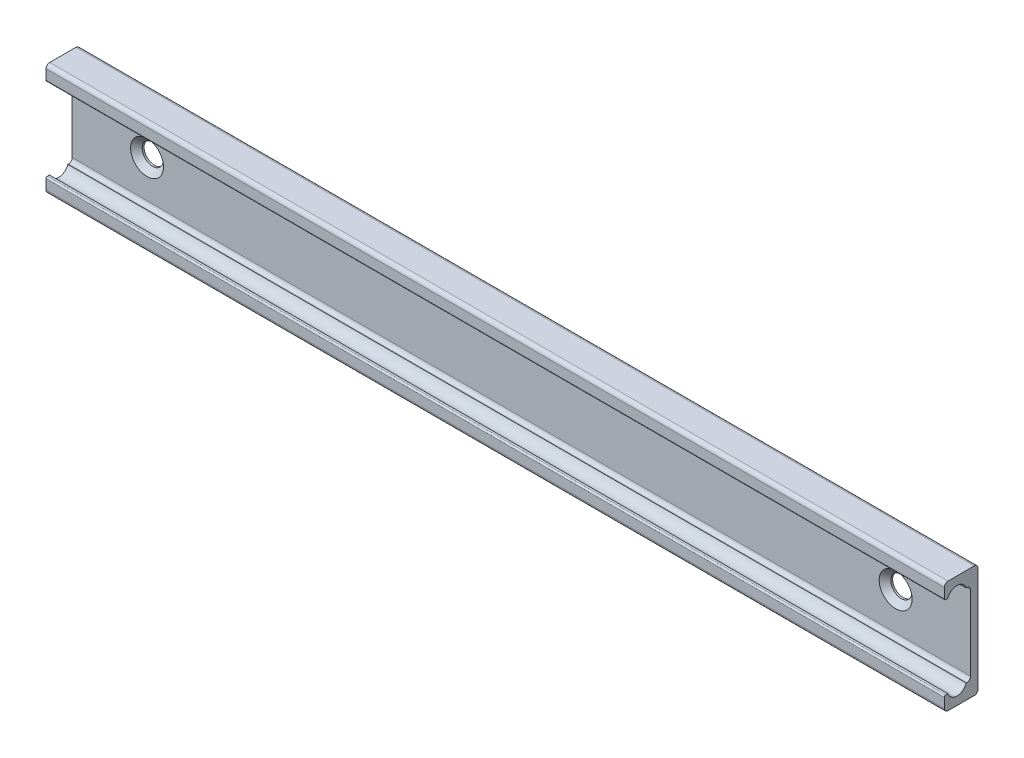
ISO-10303-21;
HEADER;
FILE_DESCRIPTION(('STEP AP214'),'2;1');
FILE_NAME('part.step','',(''),(''),'','','');
FILE_SCHEMA(('AUTOMOTIVE_DESIGN { 1 0 10303 214 1 1 1 1 }'));
ENDSEC;
DATA;
#1=APPLICATION_CONTEXT('core data for automotive mechanical design processes');
#2=APPLICATION_PROTOCOL_DEFINITION('international standard','automotive_design',2000,#1);
#3=PRODUCT_CONTEXT('',#1,'mechanical');
#4=PRODUCT('Part','Part','',(#3));
#5=PRODUCT_RELATED_PRODUCT_CATEGORY('part','',(#4));
#6=PRODUCT_DEFINITION_FORMATION('','',#4);
#7=PRODUCT_DEFINITION_CONTEXT('part definition',#1,'design');
#8=PRODUCT_DEFINITION('design','',#6,#7);
#9=PRODUCT_DEFINITION_SHAPE('','',#8);
#10=(LENGTH_UNIT() NAMED_UNIT(*) SI_UNIT(.MILLI.,.METRE.));
#11=(NAMED_UNIT(*) PLANE_ANGLE_UNIT() SI_UNIT($,.RADIAN.));
#12=(NAMED_UNIT(*) SI_UNIT($,.STERADIAN.) SOLID_ANGLE_UNIT());
#13=UNCERTAINTY_MEASURE_WITH_UNIT(LENGTH_MEASURE(1.E-05),#10,'distance_accuracy_value','');
#14=(GEOMETRIC_REPRESENTATION_CONTEXT(3) GLOBAL_UNCERTAINTY_ASSIGNED_CONTEXT((#13)) GLOBAL_UNIT_ASSIGNED_CONTEXT((#10,
#11,#12)) REPRESENTATION_CONTEXT('',''));
#15=CARTESIAN_POINT('',(0.,0.,0.));
#16=DIRECTION('',(0.,0.,1.));
#17=DIRECTION('',(1.,0.,0.));
#18=AXIS2_PLACEMENT_3D('',#15,#16,#17);
#19=CARTESIAN_POINT('',(110.,5.69999999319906,4.5));
#20=DIRECTION('',(0.,0.,1.));
#21=DIRECTION('',(1.,0.,0.));
#22=AXIS2_PLACEMENT_3D('',#19,#20,#21);
#23=PLANE('',#22);
#24=DIRECTION('',(0.,1.,0.));
#25=VECTOR('',#24,1.);
#26=CARTESIAN_POINT('',(-10.,5.69999999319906,4.5));
#27=LINE('',#26,#25);
#28=CARTESIAN_POINT('',(-10.,5.69999999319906,4.5));
#29=VERTEX_POINT('',#28);
#30=CARTESIAN_POINT('',(-10.,7.,4.5));
#31=VERTEX_POINT('',#30);
#32=EDGE_CURVE('E258',#29,#31,#27,.T.);
#33=ORIENTED_EDGE('',*,*,#32,.F.);
#34=DIRECTION('',(-1.,0.,0.));
#35=VECTOR('',#34,1.);
#36=CARTESIAN_POINT('',(110.,5.69999999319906,4.5));
#37=LINE('',#36,#35);
#38=CARTESIAN_POINT('',(110.,5.69999999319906,4.5));
#39=VERTEX_POINT('',#38);
#40=EDGE_CURVE('E9',#39,#29,#37,.T.);
#41=ORIENTED_EDGE('',*,*,#40,.F.);
#42=DIRECTION('',(0.,1.,0.));
#43=VECTOR('',#42,1.);
#44=CARTESIAN_POINT('',(110.,5.69999999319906,4.5));
#45=LINE('',#44,#43);
#46=CARTESIAN_POINT('',(110.,7.,4.5));
#47=VERTEX_POINT('',#46);
#48=EDGE_CURVE('E197',#39,#47,#45,.T.);
#49=ORIENTED_EDGE('',*,*,#48,.T.);
#50=DIRECTION('',(-1.,0.,0.));
#51=VECTOR('',#50,1.);
#52=CARTESIAN_POINT('',(114.53348651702,7.,4.5));
#53=LINE('',#52,#51);
#54=EDGE_CURVE('E294',#47,#31,#53,.T.);
#55=ORIENTED_EDGE('',*,*,#54,.T.);
#56=EDGE_LOOP('',(#33,#41,#49,#55));
#57=FACE_BOUND('',#56,.T.);
#58=ADVANCED_FACE('F14',(#57),#23,.T.);
#59=CARTESIAN_POINT('',(110.,5.69999999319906,4.3));
#60=DIRECTION('',(-1.,0.,0.));
#61=DIRECTION('',(0.,0.,1.));
#62=AXIS2_PLACEMENT_3D('',#59,#60,#61);
#63=CYLINDRICAL_SURFACE('',#62,0.2);
#64=CARTESIAN_POINT('',(-10.,5.69999999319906,4.3));
#65=DIRECTION('',(-1.,0.,0.));
#66=DIRECTION('',(0.,0.,-1.));
#67=AXIS2_PLACEMENT_3D('',#64,#65,#66);
#68=CIRCLE('',#67,0.2);
#69=CARTESIAN_POINT('',(-10.,5.49999999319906,4.3));
#70=VERTEX_POINT('',#69);
#71=EDGE_CURVE('E255',#70,#29,#68,.T.);
#72=ORIENTED_EDGE('',*,*,#71,.F.);
#73=DIRECTION('',(-1.,0.,0.));
#74=VECTOR('',#73,1.);
#75=CARTESIAN_POINT('',(110.,5.49999999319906,4.3));
#76=LINE('',#75,#74);
#77=CARTESIAN_POINT('',(110.,5.49999999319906,4.3));
#78=VERTEX_POINT('',#77);
#79=EDGE_CURVE('E23',#78,#70,#76,.T.);
#80=ORIENTED_EDGE('',*,*,#79,.F.);
#81=CARTESIAN_POINT('',(110.,5.69999999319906,4.3));
#82=DIRECTION('',(-1.,0.,0.));
#83=DIRECTION('',(0.,0.,-1.));
#84=AXIS2_PLACEMENT_3D('',#81,#82,#83);
#85=CIRCLE('',#84,0.2);
#86=EDGE_CURVE('E194',#78,#39,#85,.T.);
#87=ORIENTED_EDGE('',*,*,#86,.T.);
#88=ORIENTED_EDGE('',*,*,#40,.T.);
#89=EDGE_LOOP('',(#72,#80,#87,#88));
#90=FACE_BOUND('',#89,.T.);
#91=ADVANCED_FACE('F341',(#90),#63,.T.);
#92=CARTESIAN_POINT('',(110.,5.49999999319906,3.97687617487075));
#93=DIRECTION('',(0.,-1.,0.));
#94=DIRECTION('',(1.,0.,0.));
#95=AXIS2_PLACEMENT_3D('',#92,#93,#94);
#96=PLANE('',#95);
#97=DIRECTION('',(-1.,0.,0.));
#98=VECTOR('',#97,1.);
#99=CARTESIAN_POINT('',(110.,5.49999999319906,4.03641754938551));
#100=LINE('',#99,#98);
#101=CARTESIAN_POINT('',(110.,5.49999999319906,4.03641754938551));
#102=VERTEX_POINT('',#101);
#103=CARTESIAN_POINT('',(-10.,5.49999999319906,4.03641754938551));
#104=VERTEX_POINT('',#103);
#105=EDGE_CURVE('E31',#102,#104,#100,.T.);
#106=ORIENTED_EDGE('',*,*,#105,.F.);
#107=DIRECTION('',(0.,0.,1.));
#108=VECTOR('',#107,1.);
#109=CARTESIAN_POINT('',(110.,5.49999999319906,3.97687617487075));
#110=LINE('',#109,#108);
#111=EDGE_CURVE('E192',#102,#78,#110,.T.);
#112=ORIENTED_EDGE('',*,*,#111,.T.);
#113=ORIENTED_EDGE('',*,*,#79,.T.);
#114=DIRECTION('',(0.,0.,1.));
#115=VECTOR('',#114,1.);
#116=CARTESIAN_POINT('',(-10.,5.49999999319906,3.97687617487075));
#117=LINE('',#116,#115);
#118=EDGE_CURVE('E253',#104,#70,#117,.T.);
#119=ORIENTED_EDGE('',*,*,#118,.F.);
#120=EDGE_LOOP('',(#106,#112,#113,#119));
#121=FACE_BOUND('',#120,.T.);
#122=ADVANCED_FACE('F348',(#121),#96,.T.);
#123=CARTESIAN_POINT('',(110.,5.5,1.5));
#124=DIRECTION('',(0.,-1.,-4.7517935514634E-08));
#125=DIRECTION('',(0.,-4.7517935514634E-08,1.));
#126=AXIS2_PLACEMENT_3D('',#123,#124,#125);
#127=PLANE('',#126);
#128=DIRECTION('',(-1.,0.,0.));
#129=VECTOR('',#128,1.);
#130=CARTESIAN_POINT('',(110.,5.49999999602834,1.58358245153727));
#131=LINE('',#130,#129);
#132=CARTESIAN_POINT('',(-10.,5.49999999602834,1.58358245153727));
#133=VERTEX_POINT('',#132);
#134=CARTESIAN_POINT('',(110.,5.49999999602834,1.58358245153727));
#135=VERTEX_POINT('',#134);
#136=EDGE_CURVE('E168',#133,#135,#131,.F.);
#137=ORIENTED_EDGE('',*,*,#136,.F.);
#138=DIRECTION('',(0.,-4.7517935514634E-08,1.));
#139=VECTOR('',#138,1.);
#140=CARTESIAN_POINT('',(-10.,5.5,1.5));
#141=LINE('',#140,#139);
#142=CARTESIAN_POINT('',(-10.,5.5,1.5));
#143=VERTEX_POINT('',#142);
#144=EDGE_CURVE('E250',#143,#133,#141,.T.);
#145=ORIENTED_EDGE('',*,*,#144,.F.);
#146=DIRECTION('',(-1.,0.,0.));
#147=VECTOR('',#146,1.);
#148=CARTESIAN_POINT('',(110.,5.5,1.5));
#149=LINE('',#148,#147);
#150=CARTESIAN_POINT('',(110.,5.5,1.5));
#151=VERTEX_POINT('',#150);
#152=EDGE_CURVE('E202',#151,#143,#149,.T.);
#153=ORIENTED_EDGE('',*,*,#152,.F.);
#154=DIRECTION('',(0.,-4.7517935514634E-08,1.));
#155=VECTOR('',#154,1.);
#156=CARTESIAN_POINT('',(110.,5.5,1.5));
#157=LINE('',#156,#155);
#158=EDGE_CURVE('E189',#151,#135,#157,.T.);
#159=ORIENTED_EDGE('',*,*,#158,.T.);
#160=EDGE_LOOP('',(#137,#145,#153,#159));
#161=FACE_BOUND('',#160,.T.);
#162=ADVANCED_FACE('F357',(#161),#127,.T.);
#163=CARTESIAN_POINT('',(110.,5.,1.5));
#164=DIRECTION('',(-1.,0.,0.));
#165=DIRECTION('',(0.,0.,1.));
#166=AXIS2_PLACEMENT_3D('',#163,#164,#165);
#167=CYLINDRICAL_SURFACE('',#166,0.5);
#168=CARTESIAN_POINT('',(-10.,5.,1.5));
#169=DIRECTION('',(1.,0.,0.));
#170=DIRECTION('',(0.,0.,1.));
#171=AXIS2_PLACEMENT_3D('',#168,#169,#170);
#172=CIRCLE('',#171,0.5);
#173=CARTESIAN_POINT('',(-10.,5.,1.));
#174=VERTEX_POINT('',#173);
#175=EDGE_CURVE('E247',#174,#143,#172,.T.);
#176=ORIENTED_EDGE('',*,*,#175,.F.);
#177=DIRECTION('',(-1.,0.,0.));
#178=VECTOR('',#177,1.);
#179=CARTESIAN_POINT('',(110.,5.,1.));
#180=LINE('',#179,#178);
#181=CARTESIAN_POINT('',(110.,5.,1.));
#182=VERTEX_POINT('',#181);
#183=EDGE_CURVE('E204',#182,#174,#180,.T.);
#184=ORIENTED_EDGE('',*,*,#183,.F.);
#185=CARTESIAN_POINT('',(110.,5.,1.5));
#186=DIRECTION('',(1.,0.,0.));
#187=DIRECTION('',(0.,0.,1.));
#188=AXIS2_PLACEMENT_3D('',#185,#186,#187);
#189=CIRCLE('',#188,0.5);
#190=EDGE_CURVE('E186',#182,#151,#189,.T.);
#191=ORIENTED_EDGE('',*,*,#190,.T.);
#192=ORIENTED_EDGE('',*,*,#152,.T.);
#193=EDGE_LOOP('',(#176,#184,#191,#192));
#194=FACE_BOUND('',#193,.T.);
#195=ADVANCED_FACE('F361',(#194),#167,.F.);
#196=CARTESIAN_POINT('',(110.,-5.,1.));
#197=DIRECTION('',(0.,0.,1.));
#198=DIRECTION('',(1.,0.,0.));
#199=AXIS2_PLACEMENT_3D('',#196,#197,#198);
#200=PLANE('',#199);
#201=CARTESIAN_POINT('',(100.,0.,1.));
#202=DIRECTION('',(0.,0.,1.));
#203=DIRECTION('',(1.,0.,0.));
#204=AXIS2_PLACEMENT_3D('',#201,#202,#203);
#205=CIRCLE('',#204,2.2);
#206=CARTESIAN_POINT('',(102.2,0.,1.));
#207=VERTEX_POINT('',#206);
#208=EDGE_CURVE('E222',#207,#207,#205,.T.);
#209=ORIENTED_EDGE('',*,*,#208,.F.);
#210=EDGE_LOOP('',(#209));
#211=FACE_BOUND('',#210,.T.);
#212=CARTESIAN_POINT('',(0.,0.,1.));
#213=DIRECTION('',(0.,0.,1.));
#214=DIRECTION('',(1.,0.,0.));
#215=AXIS2_PLACEMENT_3D('',#212,#213,#214);
#216=CIRCLE('',#215,2.2);
#217=CARTESIAN_POINT('',(2.2,0.,1.));
#218=VERTEX_POINT('',#217);
#219=EDGE_CURVE('E214',#218,#218,#216,.T.);
#220=ORIENTED_EDGE('',*,*,#219,.F.);
#221=EDGE_LOOP('',(#220));
#222=FACE_BOUND('',#221,.T.);
#223=DIRECTION('',(0.,1.,0.));
#224=VECTOR('',#223,1.);
#225=CARTESIAN_POINT('',(-10.,-5.,1.));
#226=LINE('',#225,#224);
#227=CARTESIAN_POINT('',(-10.,-5.,1.));
#228=VERTEX_POINT('',#227);
#229=EDGE_CURVE('E244',#228,#174,#226,.T.);
#230=ORIENTED_EDGE('',*,*,#229,.F.);
#231=DIRECTION('',(-1.,0.,0.));
#232=VECTOR('',#231,1.);
#233=CARTESIAN_POINT('',(110.,-5.,1.));
#234=LINE('',#233,#232);
#235=CARTESIAN_POINT('',(110.,-5.,1.));
#236=VERTEX_POINT('',#235);
#237=EDGE_CURVE('E206',#236,#228,#234,.T.);
#238=ORIENTED_EDGE('',*,*,#237,.F.);
#239=DIRECTION('',(0.,1.,0.));
#240=VECTOR('',#239,1.);
#241=CARTESIAN_POINT('',(110.,-5.,1.));
#242=LINE('',#241,#240);
#243=EDGE_CURVE('E178',#236,#182,#242,.T.);
#244=ORIENTED_EDGE('',*,*,#243,.T.);
#245=ORIENTED_EDGE('',*,*,#183,.T.);
#246=EDGE_LOOP('',(#230,#238,#244,#245));
#247=FACE_BOUND('',#246,.T.);
#248=ADVANCED_FACE('F365',(#211,#222,#247),#200,.T.);
#249=CARTESIAN_POINT('',(110.,-5.,1.5));
#250=DIRECTION('',(-1.,0.,0.));
#251=DIRECTION('',(0.,0.,1.));
#252=AXIS2_PLACEMENT_3D('',#249,#250,#251);
#253=CYLINDRICAL_SURFACE('',#252,0.5);
#254=CARTESIAN_POINT('',(-10.,-5.,1.5));
#255=DIRECTION('',(1.,0.,0.));
#256=DIRECTION('',(0.,0.,-1.));
#257=AXIS2_PLACEMENT_3D('',#254,#255,#256);
#258=CIRCLE('',#257,0.5);
#259=CARTESIAN_POINT('',(-10.,-5.5,1.5));
#260=VERTEX_POINT('',#259);
#261=EDGE_CURVE('E241',#260,#228,#258,.T.);
#262=ORIENTED_EDGE('',*,*,#261,.F.);
#263=DIRECTION('',(-1.,0.,0.));
#264=VECTOR('',#263,1.);
#265=CARTESIAN_POINT('',(110.,-5.5,1.5));
#266=LINE('',#265,#264);
#267=CARTESIAN_POINT('',(110.,-5.5,1.5));
#268=VERTEX_POINT('',#267);
#269=EDGE_CURVE('E208',#268,#260,#266,.T.);
#270=ORIENTED_EDGE('',*,*,#269,.F.);
#271=CARTESIAN_POINT('',(110.,-5.,1.5));
#272=DIRECTION('',(1.,0.,0.));
#273=DIRECTION('',(0.,0.,-1.));
#274=AXIS2_PLACEMENT_3D('',#271,#272,#273);
#275=CIRCLE('',#274,0.5);
#276=EDGE_CURVE('E175',#268,#236,#275,.T.);
#277=ORIENTED_EDGE('',*,*,#276,.T.);
#278=ORIENTED_EDGE('',*,*,#237,.T.);
#279=EDGE_LOOP('',(#262,#270,#277,#278));
#280=FACE_BOUND('',#279,.T.);
#281=ADVANCED_FACE('F369',(#280),#253,.F.);
#282=CARTESIAN_POINT('',(110.,-5.5,1.5));
#283=DIRECTION('',(0.,1.,-4.7517935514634E-08));
#284=DIRECTION('',(0.,-4.7517935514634E-08,-1.));
#285=AXIS2_PLACEMENT_3D('',#282,#283,#284);
#286=PLANE('',#285);
#287=DIRECTION('',(-1.,0.,0.));
#288=VECTOR('',#287,1.);
#289=CARTESIAN_POINT('',(110.,-5.49999999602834,1.58358245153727));
#290=LINE('',#289,#288);
#291=CARTESIAN_POINT('',(110.,-5.49999999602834,1.58358245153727));
#292=VERTEX_POINT('',#291);
#293=CARTESIAN_POINT('',(-10.,-5.49999999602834,1.58358245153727));
#294=VERTEX_POINT('',#293);
#295=EDGE_CURVE('E39',#292,#294,#290,.T.);
#296=ORIENTED_EDGE('',*,*,#295,.F.);
#297=DIRECTION('',(0.,-4.7517935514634E-08,-1.));
#298=VECTOR('',#297,1.);
#299=CARTESIAN_POINT('',(110.,-5.5,1.5));
#300=LINE('',#299,#298);
#301=EDGE_CURVE('E165',#292,#268,#300,.T.);
#302=ORIENTED_EDGE('',*,*,#301,.T.);
#303=ORIENTED_EDGE('',*,*,#269,.T.);
#304=DIRECTION('',(0.,-4.7517935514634E-08,-1.));
#305=VECTOR('',#304,1.);
#306=CARTESIAN_POINT('',(-10.,-5.5,1.5));
#307=LINE('',#306,#305);
#308=EDGE_CURVE('E167',#294,#260,#307,.T.);
#309=ORIENTED_EDGE('',*,*,#308,.F.);
#310=EDGE_LOOP('',(#296,#302,#303,#309));
#311=FACE_BOUND('',#310,.T.);
#312=ADVANCED_FACE('F163',(#311),#286,.T.);
#313=CARTESIAN_POINT('',(110.,-5.49999999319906,3.97687617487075));
#314=DIRECTION('',(0.,1.,0.));
#315=DIRECTION('',(-1.,0.,0.));
#316=AXIS2_PLACEMENT_3D('',#313,#314,#315);
#317=PLANE('',#316);
#318=DIRECTION('',(-1.,0.,0.));
#319=VECTOR('',#318,1.);
#320=CARTESIAN_POINT('',(110.,-5.49999999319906,4.03641754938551));
#321=LINE('',#320,#319);
#322=CARTESIAN_POINT('',(-10.,-5.49999999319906,4.03641754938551));
#323=VERTEX_POINT('',#322);
#324=CARTESIAN_POINT('',(110.,-5.49999999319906,4.03641754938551));
#325=VERTEX_POINT('',#324);
#326=EDGE_CURVE('E153',#323,#325,#321,.F.);
#327=ORIENTED_EDGE('',*,*,#326,.F.);
#328=DIRECTION('',(0.,0.,-1.));
#329=VECTOR('',#328,1.);
#330=CARTESIAN_POINT('',(-10.,-5.49999999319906,3.97687617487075));
#331=LINE('',#330,#329);
#332=CARTESIAN_POINT('',(-10.,-5.49999999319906,4.3));
#333=VERTEX_POINT('',#332);
#334=EDGE_CURVE('E237',#333,#323,#331,.T.);
#335=ORIENTED_EDGE('',*,*,#334,.F.);
#336=DIRECTION('',(-1.,0.,0.));
#337=VECTOR('',#336,1.);
#338=CARTESIAN_POINT('',(110.,-5.49999999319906,4.3));
#339=LINE('',#338,#337);
#340=CARTESIAN_POINT('',(110.,-5.49999999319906,4.3));
#341=VERTEX_POINT('',#340);
#342=EDGE_CURVE('E210',#341,#333,#339,.T.);
#343=ORIENTED_EDGE('',*,*,#342,.F.);
#344=DIRECTION('',(0.,0.,-1.));
#345=VECTOR('',#344,1.);
#346=CARTESIAN_POINT('',(110.,-5.49999999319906,3.97687617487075));
#347=LINE('',#346,#345);
#348=EDGE_CURVE('E176',#341,#325,#347,.T.);
#349=ORIENTED_EDGE('',*,*,#348,.T.);
#350=EDGE_LOOP('',(#327,#335,#343,#349));
#351=FACE_BOUND('',#350,.T.);
#352=ADVANCED_FACE('F376',(#351),#317,.T.);
#353=CARTESIAN_POINT('',(110.,-5.69999999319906,4.3));
#354=DIRECTION('',(-1.,0.,0.));
#355=DIRECTION('',(0.,0.,1.));
#356=AXIS2_PLACEMENT_3D('',#353,#354,#355);
#357=CYLINDRICAL_SURFACE('',#356,0.2);
#358=CARTESIAN_POINT('',(-10.,-5.69999999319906,4.3));
#359=DIRECTION('',(-1.,0.,0.));
#360=DIRECTION('',(0.,0.,1.));
#361=AXIS2_PLACEMENT_3D('',#358,#359,#360);
#362=CIRCLE('',#361,0.2);
#363=CARTESIAN_POINT('',(-10.,-5.69999999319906,4.5));
#364=VERTEX_POINT('',#363);
#365=EDGE_CURVE('E234',#364,#333,#362,.T.);
#366=ORIENTED_EDGE('',*,*,#365,.F.);
#367=DIRECTION('',(-1.,0.,0.));
#368=VECTOR('',#367,1.);
#369=CARTESIAN_POINT('',(110.,-5.69999999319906,4.5));
#370=LINE('',#369,#368);
#371=CARTESIAN_POINT('',(110.,-5.69999999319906,4.5));
#372=VERTEX_POINT('',#371);
#373=EDGE_CURVE('E198',#372,#364,#370,.T.);
#374=ORIENTED_EDGE('',*,*,#373,.F.);
#375=CARTESIAN_POINT('',(110.,-5.69999999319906,4.3));
#376=DIRECTION('',(-1.,0.,0.));
#377=DIRECTION('',(0.,0.,1.));
#378=AXIS2_PLACEMENT_3D('',#375,#376,#377);
#379=CIRCLE('',#378,0.2);
#380=EDGE_CURVE('E180',#372,#341,#379,.T.);
#381=ORIENTED_EDGE('',*,*,#380,.T.);
#382=ORIENTED_EDGE('',*,*,#342,.T.);
#383=EDGE_LOOP('',(#366,#374,#381,#382));
#384=FACE_BOUND('',#383,.T.);
#385=ADVANCED_FACE('F268',(#384),#357,.T.);
#386=CARTESIAN_POINT('',(110.,-5.69999999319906,4.5));
#387=DIRECTION('',(0.,0.,1.));
#388=DIRECTION('',(1.,0.,0.));
#389=AXIS2_PLACEMENT_3D('',#386,#387,#388);
#390=PLANE('',#389);
#391=DIRECTION('',(0.,1.,0.));
#392=VECTOR('',#391,1.);
#393=CARTESIAN_POINT('',(-10.,-5.69999999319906,4.5));
#394=LINE('',#393,#392);
#395=CARTESIAN_POINT('',(-10.,-7.,4.5));
#396=VERTEX_POINT('',#395);
#397=EDGE_CURVE('E231',#396,#364,#394,.T.);
#398=ORIENTED_EDGE('',*,*,#397,.F.);
#399=DIRECTION('',(-1.,0.,0.));
#400=VECTOR('',#399,1.);
#401=CARTESIAN_POINT('',(114.53348651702,-7.,4.5));
#402=LINE('',#401,#400);
#403=CARTESIAN_POINT('',(110.,-7.,4.5));
#404=VERTEX_POINT('',#403);
#405=EDGE_CURVE('E275',#404,#396,#402,.T.);
#406=ORIENTED_EDGE('',*,*,#405,.F.);
#407=DIRECTION('',(0.,1.,0.));
#408=VECTOR('',#407,1.);
#409=CARTESIAN_POINT('',(110.,-5.69999999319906,4.5));
#410=LINE('',#409,#408);
#411=EDGE_CURVE('E262',#404,#372,#410,.T.);
#412=ORIENTED_EDGE('',*,*,#411,.T.);
#413=ORIENTED_EDGE('',*,*,#373,.T.);
#414=EDGE_LOOP('',(#398,#406,#412,#413));
#415=FACE_BOUND('',#414,.T.);
#416=ADVANCED_FACE('F273',(#415),#390,.T.);
#417=CARTESIAN_POINT('',(110.,-6.95,0.));
#418=DIRECTION('',(0.,0.,-1.));
#419=DIRECTION('',(-1.,0.,0.));
#420=AXIS2_PLACEMENT_3D('',#417,#418,#419);
#421=PLANE('',#420);
#422=CARTESIAN_POINT('',(100.,0.,0.));
#423=DIRECTION('',(0.,0.,1.));
#424=DIRECTION('',(1.,0.,0.));
#425=AXIS2_PLACEMENT_3D('',#422,#423,#424);
#426=CIRCLE('',#425,1.4);
#427=CARTESIAN_POINT('',(101.4,0.,0.));
#428=VERTEX_POINT('',#427);
#429=EDGE_CURVE('E311',#428,#428,#426,.T.);
#430=ORIENTED_EDGE('',*,*,#429,.T.);
#431=EDGE_LOOP('',(#430));
#432=FACE_BOUND('',#431,.T.);
#433=CARTESIAN_POINT('',(0.,0.,0.));
#434=DIRECTION('',(0.,0.,1.));
#435=DIRECTION('',(1.,0.,0.));
#436=AXIS2_PLACEMENT_3D('',#433,#434,#435);
#437=CIRCLE('',#436,1.4);
#438=CARTESIAN_POINT('',(1.4,0.,0.));
#439=VERTEX_POINT('',#438);
#440=EDGE_CURVE('E215',#439,#439,#437,.T.);
#441=ORIENTED_EDGE('',*,*,#440,.T.);
#442=EDGE_LOOP('',(#441));
#443=FACE_BOUND('',#442,.T.);
#444=DIRECTION('',(0.,-1.,0.));
#445=VECTOR('',#444,1.);
#446=CARTESIAN_POINT('',(-10.,-6.95,0.));
#447=LINE('',#446,#445);
#448=CARTESIAN_POINT('',(-10.,7.,0.));
#449=VERTEX_POINT('',#448);
#450=CARTESIAN_POINT('',(-10.,-7.,0.));
#451=VERTEX_POINT('',#450);
#452=EDGE_CURVE('E219',#449,#451,#447,.T.);
#453=ORIENTED_EDGE('',*,*,#452,.F.);
#454=DIRECTION('',(-1.,0.,0.));
#455=VECTOR('',#454,1.);
#456=CARTESIAN_POINT('',(114.53348651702,7.,0.));
#457=LINE('',#456,#455);
#458=CARTESIAN_POINT('',(110.,7.,0.));
#459=VERTEX_POINT('',#458);
#460=EDGE_CURVE('E300',#459,#449,#457,.T.);
#461=ORIENTED_EDGE('',*,*,#460,.F.);
#462=DIRECTION('',(0.,-1.,0.));
#463=VECTOR('',#462,1.);
#464=CARTESIAN_POINT('',(110.,-6.95,0.));
#465=LINE('',#464,#463);
#466=CARTESIAN_POINT('',(110.,-7.,0.));
#467=VERTEX_POINT('',#466);
#468=EDGE_CURVE('E260',#459,#467,#465,.T.);
#469=ORIENTED_EDGE('',*,*,#468,.T.);
#470=DIRECTION('',(-1.,0.,0.));
#471=VECTOR('',#470,1.);
#472=CARTESIAN_POINT('',(114.53348651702,-7.,0.));
#473=LINE('',#472,#471);
#474=EDGE_CURVE('E289',#467,#451,#473,.T.);
#475=ORIENTED_EDGE('',*,*,#474,.T.);
#476=EDGE_LOOP('',(#453,#461,#469,#475));
#477=FACE_BOUND('',#476,.T.);
#478=ADVANCED_FACE('F16',(#432,#443,#477),#421,.T.);
#479=CARTESIAN_POINT('',(110.,6.95,0.5));
#480=DIRECTION('',(1.,0.,0.));
#481=DIRECTION('',(0.,0.,-1.));
#482=AXIS2_PLACEMENT_3D('',#479,#480,#481);
#483=PLANE('',#482);
#484=CARTESIAN_POINT('',(110.,5.1,2.81));
#485=DIRECTION('',(-1.,0.,0.));
#486=DIRECTION('',(0.,0.,1.));
#487=AXIS2_PLACEMENT_3D('',#484,#485,#486);
#488=CIRCLE('',#487,1.29);
#489=EDGE_CURVE('E435',#102,#135,#488,.T.);
#490=ORIENTED_EDGE('',*,*,#489,.T.);
#491=ORIENTED_EDGE('',*,*,#158,.F.);
#492=ORIENTED_EDGE('',*,*,#190,.F.);
#493=ORIENTED_EDGE('',*,*,#243,.F.);
#494=ORIENTED_EDGE('',*,*,#276,.F.);
#495=ORIENTED_EDGE('',*,*,#301,.F.);
#496=CARTESIAN_POINT('',(110.,-5.1,2.81));
#497=DIRECTION('',(-1.,0.,0.));
#498=DIRECTION('',(0.,0.,-1.));
#499=AXIS2_PLACEMENT_3D('',#496,#497,#498);
#500=CIRCLE('',#499,1.29);
#501=EDGE_CURVE('E150',#292,#325,#500,.T.);
#502=ORIENTED_EDGE('',*,*,#501,.T.);
#503=ORIENTED_EDGE('',*,*,#348,.F.);
#504=ORIENTED_EDGE('',*,*,#380,.F.);
#505=ORIENTED_EDGE('',*,*,#411,.F.);
#506=CARTESIAN_POINT('',(110.,-7.,4.));
#507=DIRECTION('',(1.,0.,0.));
#508=DIRECTION('',(0.,0.,-1.));
#509=AXIS2_PLACEMENT_3D('',#506,#507,#508);
#510=CIRCLE('',#509,0.5);
#511=CARTESIAN_POINT('',(110.,-7.5,4.));
#512=VERTEX_POINT('',#511);
#513=EDGE_CURVE('E280',#512,#404,#510,.F.);
#514=ORIENTED_EDGE('',*,*,#513,.F.);
#515=DIRECTION('',(0.,0.,1.));
#516=VECTOR('',#515,1.);
#517=CARTESIAN_POINT('',(110.,-7.5,0.5));
#518=LINE('',#517,#516);
#519=CARTESIAN_POINT('',(110.,-7.5,0.5));
#520=VERTEX_POINT('',#519);
#521=EDGE_CURVE('E413',#520,#512,#518,.T.);
#522=ORIENTED_EDGE('',*,*,#521,.F.);
#523=CARTESIAN_POINT('',(110.,-7.,0.5));
#524=DIRECTION('',(1.,0.,0.));
#525=DIRECTION('',(0.,0.,-1.));
#526=AXIS2_PLACEMENT_3D('',#523,#524,#525);
#527=CIRCLE('',#526,0.5);
#528=EDGE_CURVE('E411',#467,#520,#527,.F.);
#529=ORIENTED_EDGE('',*,*,#528,.F.);
#530=ORIENTED_EDGE('',*,*,#468,.F.);
#531=CARTESIAN_POINT('',(110.,7.,0.5));
#532=DIRECTION('',(1.,0.,0.));
#533=DIRECTION('',(0.,0.,-1.));
#534=AXIS2_PLACEMENT_3D('',#531,#532,#533);
#535=CIRCLE('',#534,0.5);
#536=CARTESIAN_POINT('',(110.,7.5,0.5));
#537=VERTEX_POINT('',#536);
#538=EDGE_CURVE('E297',#537,#459,#535,.F.);
#539=ORIENTED_EDGE('',*,*,#538,.F.);
#540=DIRECTION('',(0.,0.,-1.));
#541=VECTOR('',#540,1.);
#542=CARTESIAN_POINT('',(110.,7.5,0.5));
#543=LINE('',#542,#541);
#544=CARTESIAN_POINT('',(110.,7.5,4.));
#545=VERTEX_POINT('',#544);
#546=EDGE_CURVE('E302',#545,#537,#543,.T.);
#547=ORIENTED_EDGE('',*,*,#546,.F.);
#548=CARTESIAN_POINT('',(110.,7.,4.));
#549=DIRECTION('',(1.,0.,0.));
#550=DIRECTION('',(0.,0.,-1.));
#551=AXIS2_PLACEMENT_3D('',#548,#549,#550);
#552=CIRCLE('',#551,0.5);
#553=EDGE_CURVE('E306',#47,#545,#552,.F.);
#554=ORIENTED_EDGE('',*,*,#553,.F.);
#555=ORIENTED_EDGE('',*,*,#48,.F.);
#556=ORIENTED_EDGE('',*,*,#86,.F.);
#557=ORIENTED_EDGE('',*,*,#111,.F.);
#558=EDGE_LOOP('',(#490,#491,#492,#493,#494,#495,#502,#503,#504,#505,#514,#522,#529,#530,#539,
#547,#554,#555,#556,#557));
#559=FACE_BOUND('',#558,.T.);
#560=ADVANCED_FACE('F172',(#559),#483,.T.);
#561=CARTESIAN_POINT('',(-10.,6.95,0.5));
#562=DIRECTION('',(1.,0.,0.));
#563=DIRECTION('',(0.,0.,-1.));
#564=AXIS2_PLACEMENT_3D('',#561,#562,#563);
#565=PLANE('',#564);
#566=ORIENTED_EDGE('',*,*,#144,.T.);
#567=CARTESIAN_POINT('',(-10.,5.1,2.81));
#568=DIRECTION('',(-1.,0.,0.));
#569=DIRECTION('',(0.,0.,1.));
#570=AXIS2_PLACEMENT_3D('',#567,#568,#569);
#571=CIRCLE('',#570,1.29);
#572=EDGE_CURVE('E158',#104,#133,#571,.T.);
#573=ORIENTED_EDGE('',*,*,#572,.F.);
#574=ORIENTED_EDGE('',*,*,#118,.T.);
#575=ORIENTED_EDGE('',*,*,#71,.T.);
#576=ORIENTED_EDGE('',*,*,#32,.T.);
#577=CARTESIAN_POINT('',(-10.,7.,4.));
#578=DIRECTION('',(-1.,0.,0.));
#579=DIRECTION('',(0.,0.,1.));
#580=AXIS2_PLACEMENT_3D('',#577,#578,#579);
#581=CIRCLE('',#580,0.5);
#582=CARTESIAN_POINT('',(-10.,7.5,4.));
#583=VERTEX_POINT('',#582);
#584=EDGE_CURVE('E279',#31,#583,#581,.T.);
#585=ORIENTED_EDGE('',*,*,#584,.T.);
#586=DIRECTION('',(0.,0.,-1.));
#587=VECTOR('',#586,1.);
#588=CARTESIAN_POINT('',(-10.,7.5,0.5));
#589=LINE('',#588,#587);
#590=CARTESIAN_POINT('',(-10.,7.5,0.5));
#591=VERTEX_POINT('',#590);
#592=EDGE_CURVE('E283',#583,#591,#589,.T.);
#593=ORIENTED_EDGE('',*,*,#592,.T.);
#594=CARTESIAN_POINT('',(-10.,7.,0.5));
#595=DIRECTION('',(-1.,0.,0.));
#596=DIRECTION('',(0.,0.,1.));
#597=AXIS2_PLACEMENT_3D('',#594,#595,#596);
#598=CIRCLE('',#597,0.5);
#599=EDGE_CURVE('E291',#591,#449,#598,.T.);
#600=ORIENTED_EDGE('',*,*,#599,.T.);
#601=ORIENTED_EDGE('',*,*,#452,.T.);
#602=CARTESIAN_POINT('',(-10.,-7.,0.5));
#603=DIRECTION('',(-1.,0.,0.));
#604=DIRECTION('',(0.,0.,-1.));
#605=AXIS2_PLACEMENT_3D('',#602,#603,#604);
#606=CIRCLE('',#605,0.5);
#607=CARTESIAN_POINT('',(-10.,-7.5,0.5));
#608=VERTEX_POINT('',#607);
#609=EDGE_CURVE('E419',#451,#608,#606,.T.);
#610=ORIENTED_EDGE('',*,*,#609,.T.);
#611=DIRECTION('',(0.,0.,1.));
#612=VECTOR('',#611,1.);
#613=CARTESIAN_POINT('',(-10.,-7.5,0.5));
#614=LINE('',#613,#612);
#615=CARTESIAN_POINT('',(-10.,-7.5,4.));
#616=VERTEX_POINT('',#615);
#617=EDGE_CURVE('E420',#608,#616,#614,.T.);
#618=ORIENTED_EDGE('',*,*,#617,.T.);
#619=CARTESIAN_POINT('',(-10.,-7.,4.));
#620=DIRECTION('',(-1.,0.,0.));
#621=DIRECTION('',(0.,0.,-1.));
#622=AXIS2_PLACEMENT_3D('',#619,#620,#621);
#623=CIRCLE('',#622,0.5);
#624=EDGE_CURVE('E424',#616,#396,#623,.T.);
#625=ORIENTED_EDGE('',*,*,#624,.T.);
#626=ORIENTED_EDGE('',*,*,#397,.T.);
#627=ORIENTED_EDGE('',*,*,#365,.T.);
#628=ORIENTED_EDGE('',*,*,#334,.T.);
#629=CARTESIAN_POINT('',(-10.,-5.1,2.81));
#630=DIRECTION('',(-1.,0.,0.));
#631=DIRECTION('',(0.,0.,-1.));
#632=AXIS2_PLACEMENT_3D('',#629,#630,#631);
#633=CIRCLE('',#632,1.29);
#634=EDGE_CURVE('E159',#294,#323,#633,.T.);
#635=ORIENTED_EDGE('',*,*,#634,.F.);
#636=ORIENTED_EDGE('',*,*,#308,.T.);
#637=ORIENTED_EDGE('',*,*,#261,.T.);
#638=ORIENTED_EDGE('',*,*,#229,.T.);
#639=ORIENTED_EDGE('',*,*,#175,.T.);
#640=EDGE_LOOP('',(#566,#573,#574,#575,#576,#585,#593,#600,#601,#610,#618,#625,#626,#627,#628,
#635,#636,#637,#638,#639));
#641=FACE_BOUND('',#640,.T.);
#642=ADVANCED_FACE('F390',(#641),#565,.F.);
#643=CARTESIAN_POINT('',(0.,0.,1.));
#644=DIRECTION('',(0.,0.,1.));
#645=DIRECTION('',(1.,0.,0.));
#646=AXIS2_PLACEMENT_3D('',#643,#644,#645);
#647=CONICAL_SURFACE('',#646,2.2,0.820304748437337);
#648=CARTESIAN_POINT('',(0.,0.,0.253987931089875));
#649=DIRECTION('',(0.,0.,1.));
#650=DIRECTION('',(1.,0.,0.));
#651=AXIS2_PLACEMENT_3D('',#648,#649,#650);
#652=CIRCLE('',#651,1.4);
#653=CARTESIAN_POINT('',(1.4,0.,0.253987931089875));
#654=VERTEX_POINT('',#653);
#655=EDGE_CURVE('E212',#654,#654,#652,.F.);
#656=ORIENTED_EDGE('',*,*,#655,.T.);
#657=EDGE_LOOP('',(#656));
#658=FACE_BOUND('',#657,.T.);
#659=ORIENTED_EDGE('',*,*,#219,.T.);
#660=EDGE_LOOP('',(#659));
#661=FACE_BOUND('',#660,.T.);
#662=ADVANCED_FACE('F609',(#658,#661),#647,.F.);
#663=CARTESIAN_POINT('',(0.,0.,0.));
#664=DIRECTION('',(0.,0.,1.));
#665=DIRECTION('',(1.,0.,0.));
#666=AXIS2_PLACEMENT_3D('',#663,#664,#665);
#667=CYLINDRICAL_SURFACE('',#666,1.4);
#668=ORIENTED_EDGE('',*,*,#440,.F.);
#669=EDGE_LOOP('',(#668));
#670=FACE_BOUND('',#669,.T.);
#671=ORIENTED_EDGE('',*,*,#655,.F.);
#672=EDGE_LOOP('',(#671));
#673=FACE_BOUND('',#672,.T.);
#674=ADVANCED_FACE('F338',(#670,#673),#667,.F.);
#675=CARTESIAN_POINT('',(100.,0.,1.));
#676=DIRECTION('',(0.,0.,1.));
#677=DIRECTION('',(1.,0.,0.));
#678=AXIS2_PLACEMENT_3D('',#675,#676,#677);
#679=CONICAL_SURFACE('',#678,2.2,0.820304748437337);
#680=CARTESIAN_POINT('',(100.,0.,0.253987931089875));
#681=DIRECTION('',(0.,0.,1.));
#682=DIRECTION('',(1.,0.,0.));
#683=AXIS2_PLACEMENT_3D('',#680,#681,#682);
#684=CIRCLE('',#683,1.4);
#685=CARTESIAN_POINT('',(101.4,0.,0.253987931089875));
#686=VERTEX_POINT('',#685);
#687=EDGE_CURVE('E18',#686,#686,#684,.F.);
#688=ORIENTED_EDGE('',*,*,#687,.T.);
#689=EDGE_LOOP('',(#688));
#690=FACE_BOUND('',#689,.T.);
#691=ORIENTED_EDGE('',*,*,#208,.T.);
#692=EDGE_LOOP('',(#691));
#693=FACE_BOUND('',#692,.T.);
#694=ADVANCED_FACE('F321',(#690,#693),#679,.F.);
#695=CARTESIAN_POINT('',(100.,0.,0.));
#696=DIRECTION('',(0.,0.,1.));
#697=DIRECTION('',(1.,0.,0.));
#698=AXIS2_PLACEMENT_3D('',#695,#696,#697);
#699=CYLINDRICAL_SURFACE('',#698,1.4);
#700=ORIENTED_EDGE('',*,*,#429,.F.);
#701=EDGE_LOOP('',(#700));
#702=FACE_BOUND('',#701,.T.);
#703=ORIENTED_EDGE('',*,*,#687,.F.);
#704=EDGE_LOOP('',(#703));
#705=FACE_BOUND('',#704,.T.);
#706=ADVANCED_FACE('F324',(#702,#705),#699,.F.);
#707=CARTESIAN_POINT('',(114.53348651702,7.,4.));
#708=DIRECTION('',(-1.,0.,0.));
#709=DIRECTION('',(0.,0.,1.));
#710=AXIS2_PLACEMENT_3D('',#707,#708,#709);
#711=CYLINDRICAL_SURFACE('',#710,0.5);
#712=ORIENTED_EDGE('',*,*,#54,.F.);
#713=ORIENTED_EDGE('',*,*,#553,.T.);
#714=DIRECTION('',(-1.,0.,0.));
#715=VECTOR('',#714,1.);
#716=CARTESIAN_POINT('',(114.53348651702,7.5,4.));
#717=LINE('',#716,#715);
#718=EDGE_CURVE('E305',#545,#583,#717,.T.);
#719=ORIENTED_EDGE('',*,*,#718,.T.);
#720=ORIENTED_EDGE('',*,*,#584,.F.);
#721=EDGE_LOOP('',(#712,#713,#719,#720));
#722=FACE_BOUND('',#721,.T.);
#723=ADVANCED_FACE('F326',(#722),#711,.T.);
#724=CARTESIAN_POINT('',(114.53348651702,7.5,0.5));
#725=DIRECTION('',(0.,1.,0.));
#726=DIRECTION('',(-1.,0.,0.));
#727=AXIS2_PLACEMENT_3D('',#724,#725,#726);
#728=PLANE('',#727);
#729=ORIENTED_EDGE('',*,*,#718,.F.);
#730=ORIENTED_EDGE('',*,*,#546,.T.);
#731=DIRECTION('',(-1.,0.,0.));
#732=VECTOR('',#731,1.);
#733=CARTESIAN_POINT('',(114.53348651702,7.5,0.5));
#734=LINE('',#733,#732);
#735=EDGE_CURVE('E301',#537,#591,#734,.T.);
#736=ORIENTED_EDGE('',*,*,#735,.T.);
#737=ORIENTED_EDGE('',*,*,#592,.F.);
#738=EDGE_LOOP('',(#729,#730,#736,#737));
#739=FACE_BOUND('',#738,.T.);
#740=ADVANCED_FACE('F335',(#739),#728,.T.);
#741=CARTESIAN_POINT('',(114.53348651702,7.,0.5));
#742=DIRECTION('',(-1.,0.,0.));
#743=DIRECTION('',(0.,0.,1.));
#744=AXIS2_PLACEMENT_3D('',#741,#742,#743);
#745=CYLINDRICAL_SURFACE('',#744,0.5);
#746=ORIENTED_EDGE('',*,*,#735,.F.);
#747=ORIENTED_EDGE('',*,*,#538,.T.);
#748=ORIENTED_EDGE('',*,*,#460,.T.);
#749=ORIENTED_EDGE('',*,*,#599,.F.);
#750=EDGE_LOOP('',(#746,#747,#748,#749));
#751=FACE_BOUND('',#750,.T.);
#752=ADVANCED_FACE('F401',(#751),#745,.T.);
#753=CARTESIAN_POINT('',(114.53348651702,-7.,0.5));
#754=DIRECTION('',(-1.,0.,0.));
#755=DIRECTION('',(0.,0.,1.));
#756=AXIS2_PLACEMENT_3D('',#753,#754,#755);
#757=CYLINDRICAL_SURFACE('',#756,0.5);
#758=ORIENTED_EDGE('',*,*,#474,.F.);
#759=ORIENTED_EDGE('',*,*,#528,.T.);
#760=DIRECTION('',(-1.,0.,0.));
#761=VECTOR('',#760,1.);
#762=CARTESIAN_POINT('',(114.53348651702,-7.5,0.5));
#763=LINE('',#762,#761);
#764=EDGE_CURVE('E416',#520,#608,#763,.T.);
#765=ORIENTED_EDGE('',*,*,#764,.T.);
#766=ORIENTED_EDGE('',*,*,#609,.F.);
#767=EDGE_LOOP('',(#758,#759,#765,#766));
#768=FACE_BOUND('',#767,.T.);
#769=ADVANCED_FACE('F418',(#768),#757,.T.);
#770=CARTESIAN_POINT('',(114.53348651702,-7.5,0.5));
#771=DIRECTION('',(0.,-1.,0.));
#772=DIRECTION('',(1.,0.,0.));
#773=AXIS2_PLACEMENT_3D('',#770,#771,#772);
#774=PLANE('',#773);
#775=ORIENTED_EDGE('',*,*,#764,.F.);
#776=ORIENTED_EDGE('',*,*,#521,.T.);
#777=DIRECTION('',(-1.,0.,0.));
#778=VECTOR('',#777,1.);
#779=CARTESIAN_POINT('',(114.53348651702,-7.5,4.));
#780=LINE('',#779,#778);
#781=EDGE_CURVE('E285',#512,#616,#780,.T.);
#782=ORIENTED_EDGE('',*,*,#781,.T.);
#783=ORIENTED_EDGE('',*,*,#617,.F.);
#784=EDGE_LOOP('',(#775,#776,#782,#783));
#785=FACE_BOUND('',#784,.T.);
#786=ADVANCED_FACE('F432',(#785),#774,.T.);
#787=CARTESIAN_POINT('',(114.53348651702,-7.,4.));
#788=DIRECTION('',(-1.,0.,0.));
#789=DIRECTION('',(0.,0.,1.));
#790=AXIS2_PLACEMENT_3D('',#787,#788,#789);
#791=CYLINDRICAL_SURFACE('',#790,0.5);
#792=ORIENTED_EDGE('',*,*,#781,.F.);
#793=ORIENTED_EDGE('',*,*,#513,.T.);
#794=ORIENTED_EDGE('',*,*,#405,.T.);
#795=ORIENTED_EDGE('',*,*,#624,.F.);
#796=EDGE_LOOP('',(#792,#793,#794,#795));
#797=FACE_BOUND('',#796,.T.);
#798=ADVANCED_FACE('F434',(#797),#791,.T.);
#799=CARTESIAN_POINT('',(110.,-5.1,2.81));
#800=DIRECTION('',(-1.,0.,0.));
#801=DIRECTION('',(0.,0.,1.));
#802=AXIS2_PLACEMENT_3D('',#799,#800,#801);
#803=CYLINDRICAL_SURFACE('',#802,1.29);
#804=ORIENTED_EDGE('',*,*,#295,.T.);
#805=ORIENTED_EDGE('',*,*,#634,.T.);
#806=ORIENTED_EDGE('',*,*,#326,.T.);
#807=ORIENTED_EDGE('',*,*,#501,.F.);
#808=EDGE_LOOP('',(#804,#805,#806,#807));
#809=FACE_BOUND('',#808,.T.);
#810=ADVANCED_FACE('F151',(#809),#803,.F.);
#811=CARTESIAN_POINT('',(110.,5.1,2.81));
#812=DIRECTION('',(-1.,0.,0.));
#813=DIRECTION('',(0.,0.,1.));
#814=AXIS2_PLACEMENT_3D('',#811,#812,#813);
#815=CYLINDRICAL_SURFACE('',#814,1.29);
#816=ORIENTED_EDGE('',*,*,#105,.T.);
#817=ORIENTED_EDGE('',*,*,#572,.T.);
#818=ORIENTED_EDGE('',*,*,#136,.T.);
#819=ORIENTED_EDGE('',*,*,#489,.F.);
#820=EDGE_LOOP('',(#816,#817,#818,#819));
#821=FACE_BOUND('',#820,.T.);
#822=ADVANCED_FACE('F440',(#821),#815,.F.);
#823=CLOSED_SHELL('',(#58,#91,#122,#162,#195,#248,#281,#312,#352,#385,#416,#478,#560,#642,#662,
#674,#694,#706,#723,#740,#752,#769,#786,#798,#810,#822));
#824=MANIFOLD_SOLID_BREP('B1',#823);
#825=ADVANCED_BREP_SHAPE_REPRESENTATION('',(#18,#824),#14);
#826=SHAPE_DEFINITION_REPRESENTATION(#9,#825);
ENDSEC;
END-ISO-10303-21;
